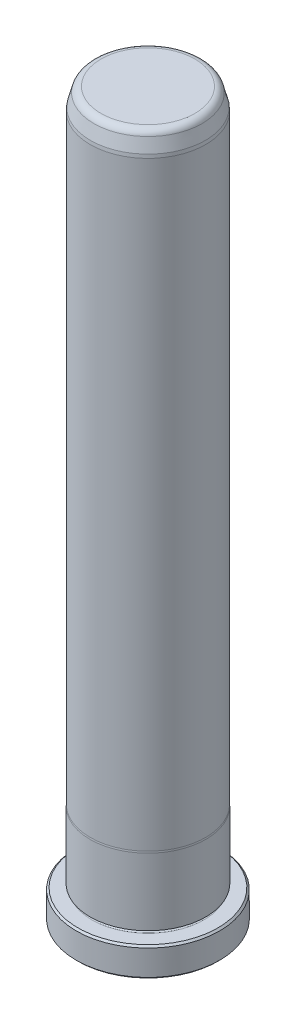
from build123d import *

# Parameters (mm, degrees)
FILLET6_R     = 1.5875
CHAMFER1_SIZE = 0.381


with BuildPart() as part:
    # Sketch1 → Revolve1 (revolve)
    with BuildSketch(Plane(origin=(0, 0, 0), x_dir=(0, 0, -1), z_dir=(1, 0, 0)), mode=Mode.PRIVATE) as revolve1_sk:
        with BuildLine():
            Line((0, 0), (15.748, 0))
            Line((15.748, 0), (15.748, 6.35))
            Line((15.748, 6.35), (12.3063, 6.35))
            ThreePointArc((12.3063, 6.35), (11.9253, 6.731), (12.3063, 7.112))
            Line((12.3063, 7.112), (12.7127, 7.112))
            Line((12.7127, 7.112), (12.7127, 21.861763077))
            Line((12.7127, 21.861763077), (12.6873, 22.225))
            Line((12.6873, 22.225), (12.6873, 154.0002))
            Line((12.6873, 154.0002), (12.620633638, 154.7622))
            Line((12.620633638, 154.7622), (11.552105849, 158.75))
            Line((11.552105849, 158.75), (0, 158.75))
            Line((0, 158.75), (0, 0))
        make_face()
    revolve(revolve1_sk.sketch.rotate(Axis((0, 0, 0), (0, -1, 0)), 180), axis=Axis((0, 0, 0), (0, -1, 0)))

    # Fillet6
    fillet6_edges = [part.edges().sort_by_distance(p)[0] for p in [
        (0, 158.75, -11.552105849),
    ]]
    fillet(fillet6_edges, radius=FILLET6_R)

    # Chamfer1
    chamfer1_edges = [part.edges().sort_by_distance(p)[0] for p in [
        (0, 6.35, -15.748),
        (0, 0, -15.748),
    ]]
    chamfer(chamfer1_edges, length=CHAMFER1_SIZE)


solid = part.part
